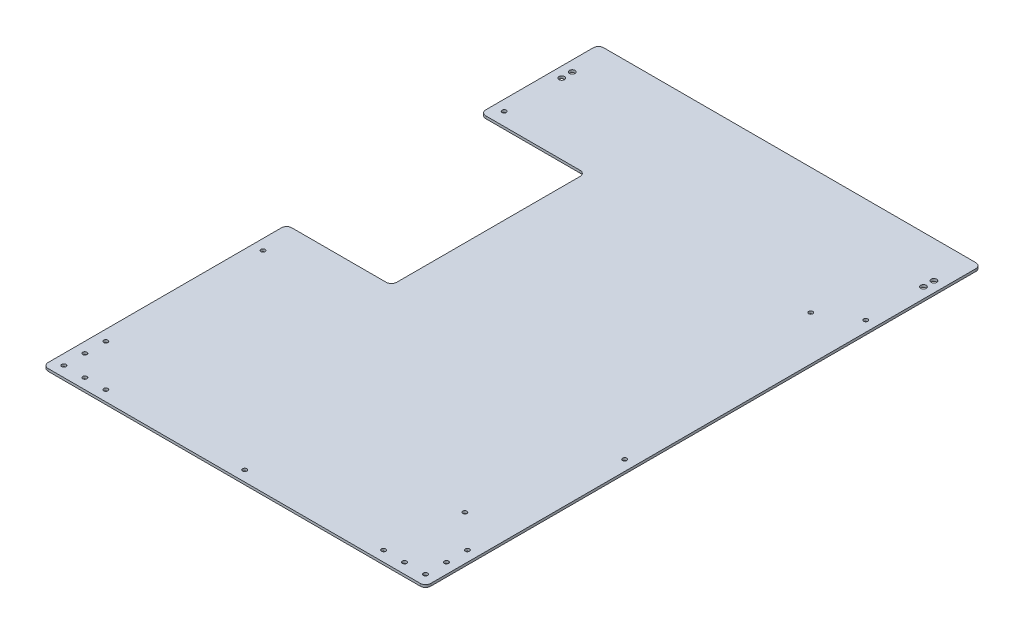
ISO-10303-21;
HEADER;
FILE_DESCRIPTION(('STEP AP214'),'2;1');
FILE_NAME('part.step','',(''),(''),'','','');
FILE_SCHEMA(('AUTOMOTIVE_DESIGN { 1 0 10303 214 1 1 1 1 }'));
ENDSEC;
DATA;
#1=APPLICATION_CONTEXT('core data for automotive mechanical design processes');
#2=APPLICATION_PROTOCOL_DEFINITION('international standard','automotive_design',2000,#1);
#3=PRODUCT_CONTEXT('',#1,'mechanical');
#4=PRODUCT('Part','Part','',(#3));
#5=PRODUCT_RELATED_PRODUCT_CATEGORY('part','',(#4));
#6=PRODUCT_DEFINITION_FORMATION('','',#4);
#7=PRODUCT_DEFINITION_CONTEXT('part definition',#1,'design');
#8=PRODUCT_DEFINITION('design','',#6,#7);
#9=PRODUCT_DEFINITION_SHAPE('','',#8);
#10=(LENGTH_UNIT() NAMED_UNIT(*) SI_UNIT(.MILLI.,.METRE.));
#11=(NAMED_UNIT(*) PLANE_ANGLE_UNIT() SI_UNIT($,.RADIAN.));
#12=(NAMED_UNIT(*) SI_UNIT($,.STERADIAN.) SOLID_ANGLE_UNIT());
#13=UNCERTAINTY_MEASURE_WITH_UNIT(LENGTH_MEASURE(1.E-05),#10,'distance_accuracy_value','');
#14=(GEOMETRIC_REPRESENTATION_CONTEXT(3) GLOBAL_UNCERTAINTY_ASSIGNED_CONTEXT((#13)) GLOBAL_UNIT_ASSIGNED_CONTEXT((#10,
#11,#12)) REPRESENTATION_CONTEXT('',''));
#15=CARTESIAN_POINT('',(0.,0.,0.));
#16=DIRECTION('',(0.,0.,1.));
#17=DIRECTION('',(1.,0.,0.));
#18=AXIS2_PLACEMENT_3D('',#15,#16,#17);
#19=CARTESIAN_POINT('',(-104.775,2.9972,0.));
#20=DIRECTION('',(1.,0.,0.));
#21=DIRECTION('',(0.,0.,-1.));
#22=AXIS2_PLACEMENT_3D('',#19,#20,#21);
#23=PLANE('',#22);
#24=DIRECTION('',(0.,0.,1.));
#25=VECTOR('',#24,1.);
#26=CARTESIAN_POINT('',(-104.775,0.,0.));
#27=LINE('',#26,#25);
#28=CARTESIAN_POINT('',(-104.775,0.,-187.325));
#29=VERTEX_POINT('',#28);
#30=CARTESIAN_POINT('',(-104.775,0.,34.925));
#31=VERTEX_POINT('',#30);
#32=EDGE_CURVE('E280',#29,#31,#27,.T.);
#33=ORIENTED_EDGE('',*,*,#32,.T.);
#34=DIRECTION('',(0.,-1.,0.));
#35=VECTOR('',#34,1.);
#36=CARTESIAN_POINT('',(-104.775,2.9972,34.925));
#37=LINE('',#36,#35);
#38=CARTESIAN_POINT('',(-104.775,2.9972,34.925));
#39=VERTEX_POINT('',#38);
#40=EDGE_CURVE('E267',#31,#39,#37,.F.);
#41=ORIENTED_EDGE('',*,*,#40,.T.);
#42=DIRECTION('',(0.,0.,1.));
#43=VECTOR('',#42,1.);
#44=CARTESIAN_POINT('',(-104.775,2.9972,0.));
#45=LINE('',#44,#43);
#46=CARTESIAN_POINT('',(-104.775,2.9972,-187.325));
#47=VERTEX_POINT('',#46);
#48=EDGE_CURVE('E286',#47,#39,#45,.T.);
#49=ORIENTED_EDGE('',*,*,#48,.F.);
#50=DIRECTION('',(0.,-1.,0.));
#51=VECTOR('',#50,1.);
#52=CARTESIAN_POINT('',(-104.775,0.,-187.325));
#53=LINE('',#52,#51);
#54=EDGE_CURVE('E263',#47,#29,#53,.T.);
#55=ORIENTED_EDGE('',*,*,#54,.T.);
#56=EDGE_LOOP('',(#33,#41,#49,#55));
#57=FACE_BOUND('',#56,.T.);
#58=ADVANCED_FACE('F39',(#57),#23,.F.);
#59=CARTESIAN_POINT('',(0.,2.9972,41.275));
#60=DIRECTION('',(0.,0.,1.));
#61=DIRECTION('',(1.,0.,0.));
#62=AXIS2_PLACEMENT_3D('',#59,#60,#61);
#63=PLANE('',#62);
#64=DIRECTION('',(-1.,0.,0.));
#65=VECTOR('',#64,1.);
#66=CARTESIAN_POINT('',(0.,0.,41.275));
#67=LINE('',#66,#65);
#68=CARTESIAN_POINT('',(-111.125,0.,41.275));
#69=VERTEX_POINT('',#68);
#70=CARTESIAN_POINT('',(-225.425,0.,41.275));
#71=VERTEX_POINT('',#70);
#72=EDGE_CURVE('E322',#69,#71,#67,.T.);
#73=ORIENTED_EDGE('',*,*,#72,.T.);
#74=DIRECTION('',(0.,-1.,0.));
#75=VECTOR('',#74,1.);
#76=CARTESIAN_POINT('',(-225.425,2.9972,41.275));
#77=LINE('',#76,#75);
#78=CARTESIAN_POINT('',(-225.425,2.9972,41.275));
#79=VERTEX_POINT('',#78);
#80=EDGE_CURVE('E248',#71,#79,#77,.F.);
#81=ORIENTED_EDGE('',*,*,#80,.T.);
#82=DIRECTION('',(-1.,0.,0.));
#83=VECTOR('',#82,1.);
#84=CARTESIAN_POINT('',(0.,2.9972,41.275));
#85=LINE('',#84,#83);
#86=CARTESIAN_POINT('',(-111.125,2.9972,41.275));
#87=VERTEX_POINT('',#86);
#88=EDGE_CURVE('E296',#87,#79,#85,.T.);
#89=ORIENTED_EDGE('',*,*,#88,.F.);
#90=DIRECTION('',(0.,-1.,0.));
#91=VECTOR('',#90,1.);
#92=CARTESIAN_POINT('',(-111.125,0.,41.275));
#93=LINE('',#92,#91);
#94=EDGE_CURVE('E244',#87,#69,#93,.T.);
#95=ORIENTED_EDGE('',*,*,#94,.T.);
#96=EDGE_LOOP('',(#73,#81,#89,#95));
#97=FACE_BOUND('',#96,.T.);
#98=ADVANCED_FACE('F370',(#97),#63,.F.);
#99=CARTESIAN_POINT('',(-231.775,2.9972,0.));
#100=DIRECTION('',(1.,0.,0.));
#101=DIRECTION('',(0.,0.,-1.));
#102=AXIS2_PLACEMENT_3D('',#99,#100,#101);
#103=PLANE('',#102);
#104=DIRECTION('',(0.,0.,1.));
#105=VECTOR('',#104,1.);
#106=CARTESIAN_POINT('',(-231.775,0.,0.));
#107=LINE('',#106,#105);
#108=CARTESIAN_POINT('',(-231.775,0.,47.625));
#109=VERTEX_POINT('',#108);
#110=CARTESIAN_POINT('',(-231.775,0.,330.2));
#111=VERTEX_POINT('',#110);
#112=EDGE_CURVE('E326',#109,#111,#107,.T.);
#113=ORIENTED_EDGE('',*,*,#112,.T.);
#114=DIRECTION('',(0.,-1.,0.));
#115=VECTOR('',#114,1.);
#116=CARTESIAN_POINT('',(-231.775,2.9972,330.2));
#117=LINE('',#116,#115);
#118=CARTESIAN_POINT('',(-231.775,2.9972,330.2));
#119=VERTEX_POINT('',#118);
#120=EDGE_CURVE('E241',#111,#119,#117,.F.);
#121=ORIENTED_EDGE('',*,*,#120,.T.);
#122=DIRECTION('',(0.,0.,1.));
#123=VECTOR('',#122,1.);
#124=CARTESIAN_POINT('',(-231.775,2.9972,0.));
#125=LINE('',#124,#123);
#126=CARTESIAN_POINT('',(-231.775,2.9972,47.625));
#127=VERTEX_POINT('',#126);
#128=EDGE_CURVE('E301',#127,#119,#125,.T.);
#129=ORIENTED_EDGE('',*,*,#128,.F.);
#130=DIRECTION('',(0.,-1.,0.));
#131=VECTOR('',#130,1.);
#132=CARTESIAN_POINT('',(-231.775,2.9972,47.625));
#133=LINE('',#132,#131);
#134=EDGE_CURVE('E237',#127,#109,#133,.T.);
#135=ORIENTED_EDGE('',*,*,#134,.T.);
#136=EDGE_LOOP('',(#113,#121,#129,#135));
#137=FACE_BOUND('',#136,.T.);
#138=ADVANCED_FACE('F362',(#137),#103,.F.);
#139=CARTESIAN_POINT('',(0.,2.9972,336.55));
#140=DIRECTION('',(0.,0.,-1.));
#141=DIRECTION('',(-1.,0.,0.));
#142=AXIS2_PLACEMENT_3D('',#139,#140,#141);
#143=PLANE('',#142);
#144=DIRECTION('',(1.,0.,0.));
#145=VECTOR('',#144,1.);
#146=CARTESIAN_POINT('',(0.,0.,336.55));
#147=LINE('',#146,#145);
#148=CARTESIAN_POINT('',(-225.425,0.,336.55));
#149=VERTEX_POINT('',#148);
#150=CARTESIAN_POINT('',(225.425,0.,336.55));
#151=VERTEX_POINT('',#150);
#152=EDGE_CURVE('E330',#149,#151,#147,.T.);
#153=ORIENTED_EDGE('',*,*,#152,.T.);
#154=DIRECTION('',(0.,-1.,0.));
#155=VECTOR('',#154,1.);
#156=CARTESIAN_POINT('',(225.425,2.9972,336.55));
#157=LINE('',#156,#155);
#158=CARTESIAN_POINT('',(225.425,2.9972,336.55));
#159=VERTEX_POINT('',#158);
#160=EDGE_CURVE('E234',#151,#159,#157,.F.);
#161=ORIENTED_EDGE('',*,*,#160,.T.);
#162=DIRECTION('',(1.,0.,0.));
#163=VECTOR('',#162,1.);
#164=CARTESIAN_POINT('',(0.,2.9972,336.55));
#165=LINE('',#164,#163);
#166=CARTESIAN_POINT('',(-225.425,2.9972,336.55));
#167=VERTEX_POINT('',#166);
#168=EDGE_CURVE('E310',#167,#159,#165,.T.);
#169=ORIENTED_EDGE('',*,*,#168,.F.);
#170=DIRECTION('',(0.,-1.,0.));
#171=VECTOR('',#170,1.);
#172=CARTESIAN_POINT('',(-225.425,2.9972,336.55));
#173=LINE('',#172,#171);
#174=EDGE_CURVE('E230',#167,#149,#173,.T.);
#175=ORIENTED_EDGE('',*,*,#174,.T.);
#176=EDGE_LOOP('',(#153,#161,#169,#175));
#177=FACE_BOUND('',#176,.T.);
#178=ADVANCED_FACE('F352',(#177),#143,.F.);
#179=CARTESIAN_POINT('',(231.775,2.9972,0.));
#180=DIRECTION('',(1.,0.,0.));
#181=DIRECTION('',(0.,0.,-1.));
#182=AXIS2_PLACEMENT_3D('',#179,#180,#181);
#183=PLANE('',#182);
#184=DIRECTION('',(0.,0.,1.));
#185=VECTOR('',#184,1.);
#186=CARTESIAN_POINT('',(231.775,0.,0.));
#187=LINE('',#186,#185);
#188=CARTESIAN_POINT('',(231.775,0.,-330.2));
#189=VERTEX_POINT('',#188);
#190=CARTESIAN_POINT('',(231.775,0.,330.2));
#191=VERTEX_POINT('',#190);
#192=EDGE_CURVE('E176',#189,#191,#187,.T.);
#193=ORIENTED_EDGE('',*,*,#192,.F.);
#194=DIRECTION('',(0.,-1.,0.));
#195=VECTOR('',#194,1.);
#196=CARTESIAN_POINT('',(231.775,2.9972,-330.2));
#197=LINE('',#196,#195);
#198=CARTESIAN_POINT('',(231.775,2.9972,-330.2));
#199=VERTEX_POINT('',#198);
#200=EDGE_CURVE('E211',#189,#199,#197,.F.);
#201=ORIENTED_EDGE('',*,*,#200,.T.);
#202=DIRECTION('',(0.,0.,1.));
#203=VECTOR('',#202,1.);
#204=CARTESIAN_POINT('',(231.775,2.9972,0.));
#205=LINE('',#204,#203);
#206=CARTESIAN_POINT('',(231.775,2.9972,330.2));
#207=VERTEX_POINT('',#206);
#208=EDGE_CURVE('E314',#199,#207,#205,.T.);
#209=ORIENTED_EDGE('',*,*,#208,.T.);
#210=DIRECTION('',(0.,-1.,0.));
#211=VECTOR('',#210,1.);
#212=CARTESIAN_POINT('',(231.775,0.,330.2));
#213=LINE('',#212,#211);
#214=EDGE_CURVE('E207',#207,#191,#213,.T.);
#215=ORIENTED_EDGE('',*,*,#214,.T.);
#216=EDGE_LOOP('',(#193,#201,#209,#215));
#217=FACE_BOUND('',#216,.T.);
#218=ADVANCED_FACE('F341',(#217),#183,.T.);
#219=CARTESIAN_POINT('',(0.,2.9972,-336.55));
#220=DIRECTION('',(0.,0.,-1.));
#221=DIRECTION('',(-1.,0.,0.));
#222=AXIS2_PLACEMENT_3D('',#219,#220,#221);
#223=PLANE('',#222);
#224=DIRECTION('',(1.,0.,0.));
#225=VECTOR('',#224,1.);
#226=CARTESIAN_POINT('',(0.,2.9972,-336.55));
#227=LINE('',#226,#225);
#228=CARTESIAN_POINT('',(-225.425,2.9972,-336.55));
#229=VERTEX_POINT('',#228);
#230=CARTESIAN_POINT('',(225.425,2.9972,-336.55));
#231=VERTEX_POINT('',#230);
#232=EDGE_CURVE('E309',#229,#231,#227,.T.);
#233=ORIENTED_EDGE('',*,*,#232,.T.);
#234=DIRECTION('',(0.,-1.,0.));
#235=VECTOR('',#234,1.);
#236=CARTESIAN_POINT('',(225.425,2.9972,-336.55));
#237=LINE('',#236,#235);
#238=CARTESIAN_POINT('',(225.425,0.,-336.55));
#239=VERTEX_POINT('',#238);
#240=EDGE_CURVE('E166',#231,#239,#237,.T.);
#241=ORIENTED_EDGE('',*,*,#240,.T.);
#242=DIRECTION('',(1.,0.,0.));
#243=VECTOR('',#242,1.);
#244=CARTESIAN_POINT('',(0.,0.,-336.55));
#245=LINE('',#244,#243);
#246=CARTESIAN_POINT('',(-225.425,0.,-336.55));
#247=VERTEX_POINT('',#246);
#248=EDGE_CURVE('E157',#247,#239,#245,.T.);
#249=ORIENTED_EDGE('',*,*,#248,.F.);
#250=DIRECTION('',(0.,-1.,0.));
#251=VECTOR('',#250,1.);
#252=CARTESIAN_POINT('',(-225.425,2.9972,-336.55));
#253=LINE('',#252,#251);
#254=EDGE_CURVE('E172',#247,#229,#253,.F.);
#255=ORIENTED_EDGE('',*,*,#254,.T.);
#256=EDGE_LOOP('',(#233,#241,#249,#255));
#257=FACE_BOUND('',#256,.T.);
#258=ADVANCED_FACE('F171',(#257),#223,.T.);
#259=CARTESIAN_POINT('',(-231.775,0.,-330.2));
#260=VERTEX_POINT('',#259);
#261=CARTESIAN_POINT('',(-231.775,0.,-200.025));
#262=VERTEX_POINT('',#261);
#263=EDGE_CURVE('E159',#260,#262,#107,.T.);
#264=ORIENTED_EDGE('',*,*,#263,.T.);
#265=DIRECTION('',(0.,-1.,0.));
#266=VECTOR('',#265,1.);
#267=CARTESIAN_POINT('',(-231.775,2.9972,-200.025));
#268=LINE('',#267,#266);
#269=CARTESIAN_POINT('',(-231.775,2.9972,-200.025));
#270=VERTEX_POINT('',#269);
#271=EDGE_CURVE('E260',#262,#270,#268,.F.);
#272=ORIENTED_EDGE('',*,*,#271,.T.);
#273=CARTESIAN_POINT('',(-231.775,2.9972,-330.2));
#274=VERTEX_POINT('',#273);
#275=EDGE_CURVE('E188',#274,#270,#125,.T.);
#276=ORIENTED_EDGE('',*,*,#275,.F.);
#277=DIRECTION('',(0.,-1.,0.));
#278=VECTOR('',#277,1.);
#279=CARTESIAN_POINT('',(-231.775,0.,-330.2));
#280=LINE('',#279,#278);
#281=EDGE_CURVE('E257',#274,#260,#280,.T.);
#282=ORIENTED_EDGE('',*,*,#281,.T.);
#283=EDGE_LOOP('',(#264,#272,#276,#282));
#284=FACE_BOUND('',#283,.T.);
#285=ADVANCED_FACE('F405',(#284),#103,.F.);
#286=CARTESIAN_POINT('',(0.,2.9972,-193.675));
#287=DIRECTION('',(0.,0.,-1.));
#288=DIRECTION('',(-1.,0.,0.));
#289=AXIS2_PLACEMENT_3D('',#286,#287,#288);
#290=PLANE('',#289);
#291=DIRECTION('',(1.,0.,0.));
#292=VECTOR('',#291,1.);
#293=CARTESIAN_POINT('',(0.,2.9972,-193.675));
#294=LINE('',#293,#292);
#295=CARTESIAN_POINT('',(-225.425,2.9972,-193.675));
#296=VERTEX_POINT('',#295);
#297=CARTESIAN_POINT('',(-111.125,2.9972,-193.675));
#298=VERTEX_POINT('',#297);
#299=EDGE_CURVE('E182',#296,#298,#294,.T.);
#300=ORIENTED_EDGE('',*,*,#299,.F.);
#301=DIRECTION('',(0.,-1.,0.));
#302=VECTOR('',#301,1.);
#303=CARTESIAN_POINT('',(-225.425,2.9972,-193.675));
#304=LINE('',#303,#302);
#305=CARTESIAN_POINT('',(-225.425,0.,-193.675));
#306=VERTEX_POINT('',#305);
#307=EDGE_CURVE('E253',#296,#306,#304,.T.);
#308=ORIENTED_EDGE('',*,*,#307,.T.);
#309=DIRECTION('',(1.,0.,0.));
#310=VECTOR('',#309,1.);
#311=CARTESIAN_POINT('',(0.,0.,-193.675));
#312=LINE('',#311,#310);
#313=CARTESIAN_POINT('',(-111.125,0.,-193.675));
#314=VERTEX_POINT('',#313);
#315=EDGE_CURVE('E191',#306,#314,#312,.T.);
#316=ORIENTED_EDGE('',*,*,#315,.T.);
#317=DIRECTION('',(0.,-1.,0.));
#318=VECTOR('',#317,1.);
#319=CARTESIAN_POINT('',(-111.125,2.9972,-193.675));
#320=LINE('',#319,#318);
#321=EDGE_CURVE('E55',#314,#298,#320,.F.);
#322=ORIENTED_EDGE('',*,*,#321,.T.);
#323=EDGE_LOOP('',(#300,#308,#316,#322));
#324=FACE_BOUND('',#323,.T.);
#325=ADVANCED_FACE('F283',(#324),#290,.F.);
#326=CARTESIAN_POINT('',(0.,2.9972,0.));
#327=DIRECTION('',(0.,1.,0.));
#328=DIRECTION('',(0.,0.,1.));
#329=AXIS2_PLACEMENT_3D('',#326,#327,#328);
#330=PLANE('',#329);
#331=CARTESIAN_POINT('',(219.075,2.9972,-279.4));
#332=DIRECTION('',(0.,1.,0.));
#333=DIRECTION('',(0.,0.,1.));
#334=AXIS2_PLACEMENT_3D('',#331,#332,#333);
#335=CIRCLE('',#334,3.373501);
#336=CARTESIAN_POINT('',(219.075,2.9972,-276.026499));
#337=VERTEX_POINT('',#336);
#338=EDGE_CURVE('E1030',#337,#337,#335,.T.);
#339=ORIENTED_EDGE('',*,*,#338,.F.);
#340=EDGE_LOOP('',(#339));
#341=FACE_BOUND('',#340,.T.);
#342=CARTESIAN_POINT('',(219.075,2.9972,-292.1));
#343=DIRECTION('',(0.,1.,0.));
#344=DIRECTION('',(0.,0.,1.));
#345=AXIS2_PLACEMENT_3D('',#342,#343,#344);
#346=CIRCLE('',#345,3.373501);
#347=CARTESIAN_POINT('',(219.075,2.9972,-288.726499));
#348=VERTEX_POINT('',#347);
#349=EDGE_CURVE('E1020',#348,#348,#346,.T.);
#350=ORIENTED_EDGE('',*,*,#349,.F.);
#351=EDGE_LOOP('',(#350));
#352=FACE_BOUND('',#351,.T.);
#353=CARTESIAN_POINT('',(-219.075,2.9972,-279.4));
#354=DIRECTION('',(0.,1.,0.));
#355=DIRECTION('',(0.,0.,1.));
#356=AXIS2_PLACEMENT_3D('',#353,#354,#355);
#357=CIRCLE('',#356,3.373501);
#358=CARTESIAN_POINT('',(-219.075,2.9972,-276.026499));
#359=VERTEX_POINT('',#358);
#360=EDGE_CURVE('E1010',#359,#359,#357,.T.);
#361=ORIENTED_EDGE('',*,*,#360,.F.);
#362=EDGE_LOOP('',(#361));
#363=FACE_BOUND('',#362,.T.);
#364=CARTESIAN_POINT('',(-219.075,2.9972,-292.1));
#365=DIRECTION('',(0.,1.,0.));
#366=DIRECTION('',(0.,0.,1.));
#367=AXIS2_PLACEMENT_3D('',#364,#365,#366);
#368=CIRCLE('',#367,3.373501);
#369=CARTESIAN_POINT('',(-219.075,2.9972,-288.726499));
#370=VERTEX_POINT('',#369);
#371=EDGE_CURVE('E1000',#370,#370,#368,.T.);
#372=ORIENTED_EDGE('',*,*,#371,.F.);
#373=EDGE_LOOP('',(#372));
#374=FACE_BOUND('',#373,.T.);
#375=CARTESIAN_POINT('',(-219.075,2.9972,323.85));
#376=DIRECTION('',(0.,1.,0.));
#377=DIRECTION('',(0.,0.,1.));
#378=AXIS2_PLACEMENT_3D('',#375,#376,#377);
#379=CIRCLE('',#378,2.55269999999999);
#380=CARTESIAN_POINT('',(-219.075,2.9972,326.4027));
#381=VERTEX_POINT('',#380);
#382=EDGE_CURVE('E990',#381,#381,#379,.T.);
#383=ORIENTED_EDGE('',*,*,#382,.F.);
#384=EDGE_LOOP('',(#383));
#385=FACE_BOUND('',#384,.T.);
#386=CARTESIAN_POINT('',(-219.075,2.9972,298.45));
#387=DIRECTION('',(0.,1.,0.));
#388=DIRECTION('',(0.,0.,1.));
#389=AXIS2_PLACEMENT_3D('',#386,#387,#388);
#390=CIRCLE('',#389,2.55269999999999);
#391=CARTESIAN_POINT('',(-219.075,2.9972,301.0027));
#392=VERTEX_POINT('',#391);
#393=EDGE_CURVE('E980',#392,#392,#390,.T.);
#394=ORIENTED_EDGE('',*,*,#393,.F.);
#395=EDGE_LOOP('',(#394));
#396=FACE_BOUND('',#395,.T.);
#397=CARTESIAN_POINT('',(-219.075,2.9972,273.05));
#398=DIRECTION('',(0.,1.,0.));
#399=DIRECTION('',(0.,0.,1.));
#400=AXIS2_PLACEMENT_3D('',#397,#398,#399);
#401=CIRCLE('',#400,2.55269999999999);
#402=CARTESIAN_POINT('',(-219.075,2.9972,275.6027));
#403=VERTEX_POINT('',#402);
#404=EDGE_CURVE('E970',#403,#403,#401,.T.);
#405=ORIENTED_EDGE('',*,*,#404,.F.);
#406=EDGE_LOOP('',(#405));
#407=FACE_BOUND('',#406,.T.);
#408=CARTESIAN_POINT('',(-193.675,2.9972,323.85));
#409=DIRECTION('',(0.,1.,0.));
#410=DIRECTION('',(0.,0.,1.));
#411=AXIS2_PLACEMENT_3D('',#408,#409,#410);
#412=CIRCLE('',#411,2.55269999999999);
#413=CARTESIAN_POINT('',(-193.675,2.9972,326.4027));
#414=VERTEX_POINT('',#413);
#415=EDGE_CURVE('E960',#414,#414,#412,.T.);
#416=ORIENTED_EDGE('',*,*,#415,.F.);
#417=EDGE_LOOP('',(#416));
#418=FACE_BOUND('',#417,.T.);
#419=CARTESIAN_POINT('',(-168.275,2.9972,323.85));
#420=DIRECTION('',(0.,1.,0.));
#421=DIRECTION('',(0.,0.,1.));
#422=AXIS2_PLACEMENT_3D('',#419,#420,#421);
#423=CIRCLE('',#422,2.55269999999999);
#424=CARTESIAN_POINT('',(-168.275,2.9972,326.4027));
#425=VERTEX_POINT('',#424);
#426=EDGE_CURVE('E950',#425,#425,#423,.T.);
#427=ORIENTED_EDGE('',*,*,#426,.F.);
#428=EDGE_LOOP('',(#427));
#429=FACE_BOUND('',#428,.T.);
#430=CARTESIAN_POINT('',(168.275,2.9972,323.85));
#431=DIRECTION('',(0.,1.,0.));
#432=DIRECTION('',(0.,0.,1.));
#433=AXIS2_PLACEMENT_3D('',#430,#431,#432);
#434=CIRCLE('',#433,2.55269999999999);
#435=CARTESIAN_POINT('',(168.275,2.9972,326.4027));
#436=VERTEX_POINT('',#435);
#437=EDGE_CURVE('E940',#436,#436,#434,.T.);
#438=ORIENTED_EDGE('',*,*,#437,.F.);
#439=EDGE_LOOP('',(#438));
#440=FACE_BOUND('',#439,.T.);
#441=CARTESIAN_POINT('',(193.675,2.9972,323.85));
#442=DIRECTION('',(0.,1.,0.));
#443=DIRECTION('',(0.,0.,1.));
#444=AXIS2_PLACEMENT_3D('',#441,#442,#443);
#445=CIRCLE('',#444,2.55269999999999);
#446=CARTESIAN_POINT('',(193.675,2.9972,326.4027));
#447=VERTEX_POINT('',#446);
#448=EDGE_CURVE('E930',#447,#447,#445,.T.);
#449=ORIENTED_EDGE('',*,*,#448,.F.);
#450=EDGE_LOOP('',(#449));
#451=FACE_BOUND('',#450,.T.);
#452=CARTESIAN_POINT('',(219.075,2.9972,323.85));
#453=DIRECTION('',(0.,1.,0.));
#454=DIRECTION('',(0.,0.,1.));
#455=AXIS2_PLACEMENT_3D('',#452,#453,#454);
#456=CIRCLE('',#455,2.55269999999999);
#457=CARTESIAN_POINT('',(219.075,2.9972,326.4027));
#458=VERTEX_POINT('',#457);
#459=EDGE_CURVE('E920',#458,#458,#456,.T.);
#460=ORIENTED_EDGE('',*,*,#459,.F.);
#461=EDGE_LOOP('',(#460));
#462=FACE_BOUND('',#461,.T.);
#463=CARTESIAN_POINT('',(219.075,2.9972,298.45));
#464=DIRECTION('',(0.,1.,0.));
#465=DIRECTION('',(0.,0.,1.));
#466=AXIS2_PLACEMENT_3D('',#463,#464,#465);
#467=CIRCLE('',#466,2.55269999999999);
#468=CARTESIAN_POINT('',(219.075,2.9972,301.0027));
#469=VERTEX_POINT('',#468);
#470=EDGE_CURVE('E910',#469,#469,#467,.T.);
#471=ORIENTED_EDGE('',*,*,#470,.F.);
#472=EDGE_LOOP('',(#471));
#473=FACE_BOUND('',#472,.T.);
#474=CARTESIAN_POINT('',(219.075,2.9972,273.05));
#475=DIRECTION('',(0.,1.,0.));
#476=DIRECTION('',(0.,0.,1.));
#477=AXIS2_PLACEMENT_3D('',#474,#475,#476);
#478=CIRCLE('',#477,2.55269999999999);
#479=CARTESIAN_POINT('',(219.075,2.9972,275.6027));
#480=VERTEX_POINT('',#479);
#481=EDGE_CURVE('E900',#480,#480,#478,.T.);
#482=ORIENTED_EDGE('',*,*,#481,.F.);
#483=EDGE_LOOP('',(#482));
#484=FACE_BOUND('',#483,.T.);
#485=CARTESIAN_POINT('',(-219.075,2.9972,82.5500000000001));
#486=DIRECTION('',(0.,1.,0.));
#487=DIRECTION('',(0.,0.,1.));
#488=AXIS2_PLACEMENT_3D('',#485,#486,#487);
#489=CIRCLE('',#488,2.55269999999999);
#490=CARTESIAN_POINT('',(-219.075,2.9972,85.1027000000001));
#491=VERTEX_POINT('',#490);
#492=EDGE_CURVE('E890',#491,#491,#489,.T.);
#493=ORIENTED_EDGE('',*,*,#492,.F.);
#494=EDGE_LOOP('',(#493));
#495=FACE_BOUND('',#494,.T.);
#496=CARTESIAN_POINT('',(-219.075,2.9972,-209.55));
#497=DIRECTION('',(0.,1.,0.));
#498=DIRECTION('',(0.,0.,1.));
#499=AXIS2_PLACEMENT_3D('',#496,#497,#498);
#500=CIRCLE('',#499,2.55269999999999);
#501=CARTESIAN_POINT('',(-219.075,2.9972,-206.9973));
#502=VERTEX_POINT('',#501);
#503=EDGE_CURVE('E880',#502,#502,#500,.T.);
#504=ORIENTED_EDGE('',*,*,#503,.F.);
#505=EDGE_LOOP('',(#504));
#506=FACE_BOUND('',#505,.T.);
#507=CARTESIAN_POINT('',(219.075,2.9972,-209.55));
#508=DIRECTION('',(0.,1.,0.));
#509=DIRECTION('',(0.,0.,1.));
#510=AXIS2_PLACEMENT_3D('',#507,#508,#509);
#511=CIRCLE('',#510,2.55269999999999);
#512=CARTESIAN_POINT('',(219.075,2.9972,-206.9973));
#513=VERTEX_POINT('',#512);
#514=EDGE_CURVE('E870',#513,#513,#511,.T.);
#515=ORIENTED_EDGE('',*,*,#514,.F.);
#516=EDGE_LOOP('',(#515));
#517=FACE_BOUND('',#516,.T.);
#518=CARTESIAN_POINT('',(219.075,2.9972,82.5500000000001));
#519=DIRECTION('',(0.,1.,0.));
#520=DIRECTION('',(0.,0.,1.));
#521=AXIS2_PLACEMENT_3D('',#518,#519,#520);
#522=CIRCLE('',#521,2.55269999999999);
#523=CARTESIAN_POINT('',(219.075,2.9972,85.1027000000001));
#524=VERTEX_POINT('',#523);
#525=EDGE_CURVE('E833',#524,#524,#522,.T.);
#526=ORIENTED_EDGE('',*,*,#525,.F.);
#527=EDGE_LOOP('',(#526));
#528=FACE_BOUND('',#527,.T.);
#529=CARTESIAN_POINT('',(0.,2.9972,323.85));
#530=DIRECTION('',(0.,1.,0.));
#531=DIRECTION('',(0.,0.,1.));
#532=AXIS2_PLACEMENT_3D('',#529,#530,#531);
#533=CIRCLE('',#532,2.55269999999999);
#534=CARTESIAN_POINT('',(0.,2.9972,326.4027));
#535=VERTEX_POINT('',#534);
#536=EDGE_CURVE('E822',#535,#535,#533,.T.);
#537=ORIENTED_EDGE('',*,*,#536,.F.);
#538=EDGE_LOOP('',(#537));
#539=FACE_BOUND('',#538,.T.);
#540=CARTESIAN_POINT('',(177.8,2.9972,-184.15));
#541=DIRECTION('',(0.,1.,0.));
#542=DIRECTION('',(0.,0.,1.));
#543=AXIS2_PLACEMENT_3D('',#540,#541,#542);
#544=CIRCLE('',#543,2.55269999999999);
#545=CARTESIAN_POINT('',(177.8,2.9972,-181.5973));
#546=VERTEX_POINT('',#545);
#547=EDGE_CURVE('E829',#546,#546,#544,.T.);
#548=ORIENTED_EDGE('',*,*,#547,.F.);
#549=EDGE_LOOP('',(#548));
#550=FACE_BOUND('',#549,.T.);
#551=CARTESIAN_POINT('',(177.8,2.9972,234.95));
#552=DIRECTION('',(0.,1.,0.));
#553=DIRECTION('',(0.,0.,1.));
#554=AXIS2_PLACEMENT_3D('',#551,#552,#553);
#555=CIRCLE('',#554,2.55269999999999);
#556=CARTESIAN_POINT('',(177.8,2.9972,237.5027));
#557=VERTEX_POINT('',#556);
#558=EDGE_CURVE('E843',#557,#557,#555,.T.);
#559=ORIENTED_EDGE('',*,*,#558,.F.);
#560=EDGE_LOOP('',(#559));
#561=FACE_BOUND('',#560,.T.);
#562=ORIENTED_EDGE('',*,*,#208,.F.);
#563=CARTESIAN_POINT('',(225.425,2.9972,-330.2));
#564=DIRECTION('',(0.,1.,0.));
#565=DIRECTION('',(0.,0.,1.));
#566=AXIS2_PLACEMENT_3D('',#563,#564,#565);
#567=CIRCLE('',#566,6.35);
#568=EDGE_CURVE('E227',#199,#231,#567,.T.);
#569=ORIENTED_EDGE('',*,*,#568,.T.);
#570=ORIENTED_EDGE('',*,*,#232,.F.);
#571=CARTESIAN_POINT('',(-225.425,2.9972,-330.2));
#572=DIRECTION('',(0.,1.,0.));
#573=DIRECTION('',(0.,0.,1.));
#574=AXIS2_PLACEMENT_3D('',#571,#572,#573);
#575=CIRCLE('',#574,6.35);
#576=EDGE_CURVE('E180',#229,#274,#575,.T.);
#577=ORIENTED_EDGE('',*,*,#576,.T.);
#578=ORIENTED_EDGE('',*,*,#275,.T.);
#579=CARTESIAN_POINT('',(-225.425,2.9972,-200.025));
#580=DIRECTION('',(0.,1.,0.));
#581=DIRECTION('',(0.,0.,1.));
#582=AXIS2_PLACEMENT_3D('',#579,#580,#581);
#583=CIRCLE('',#582,6.35);
#584=EDGE_CURVE('E62',#270,#296,#583,.T.);
#585=ORIENTED_EDGE('',*,*,#584,.T.);
#586=ORIENTED_EDGE('',*,*,#299,.T.);
#587=CARTESIAN_POINT('',(-111.125,2.9972,-187.325));
#588=DIRECTION('',(0.,1.,0.));
#589=DIRECTION('',(0.,0.,1.));
#590=AXIS2_PLACEMENT_3D('',#587,#588,#589);
#591=CIRCLE('',#590,6.35);
#592=EDGE_CURVE('E11',#298,#47,#591,.F.);
#593=ORIENTED_EDGE('',*,*,#592,.T.);
#594=ORIENTED_EDGE('',*,*,#48,.T.);
#595=CARTESIAN_POINT('',(-111.125,2.9972,34.925));
#596=DIRECTION('',(0.,1.,0.));
#597=DIRECTION('',(0.,0.,1.));
#598=AXIS2_PLACEMENT_3D('',#595,#596,#597);
#599=CIRCLE('',#598,6.35);
#600=EDGE_CURVE('E273',#39,#87,#599,.F.);
#601=ORIENTED_EDGE('',*,*,#600,.T.);
#602=ORIENTED_EDGE('',*,*,#88,.T.);
#603=CARTESIAN_POINT('',(-225.425,2.9972,47.625));
#604=DIRECTION('',(0.,1.,0.));
#605=DIRECTION('',(0.,0.,1.));
#606=AXIS2_PLACEMENT_3D('',#603,#604,#605);
#607=CIRCLE('',#606,6.35);
#608=EDGE_CURVE('E218',#79,#127,#607,.T.);
#609=ORIENTED_EDGE('',*,*,#608,.T.);
#610=ORIENTED_EDGE('',*,*,#128,.T.);
#611=CARTESIAN_POINT('',(-225.425,2.9972,330.2));
#612=DIRECTION('',(0.,1.,0.));
#613=DIRECTION('',(0.,0.,1.));
#614=AXIS2_PLACEMENT_3D('',#611,#612,#613);
#615=CIRCLE('',#614,6.35);
#616=EDGE_CURVE('E221',#119,#167,#615,.T.);
#617=ORIENTED_EDGE('',*,*,#616,.T.);
#618=ORIENTED_EDGE('',*,*,#168,.T.);
#619=CARTESIAN_POINT('',(225.425,2.9972,330.2));
#620=DIRECTION('',(0.,1.,0.));
#621=DIRECTION('',(0.,0.,1.));
#622=AXIS2_PLACEMENT_3D('',#619,#620,#621);
#623=CIRCLE('',#622,6.35);
#624=EDGE_CURVE('E224',#159,#207,#623,.T.);
#625=ORIENTED_EDGE('',*,*,#624,.T.);
#626=EDGE_LOOP('',(#562,#569,#570,#577,#578,#585,#586,#593,#594,#601,#602,#609,#610,#617,#618,#625));
#627=FACE_BOUND('',#626,.T.);
#628=ADVANCED_FACE('F291',(#341,#352,#363,#374,#385,#396,#407,#418,#429,#440,#451,#462,#473,
#484,#495,#506,#517,#528,#539,#550,#561,#627),#330,.T.);
#629=CARTESIAN_POINT('',(0.,0.,0.));
#630=DIRECTION('',(0.,1.,0.));
#631=DIRECTION('',(0.,0.,1.));
#632=AXIS2_PLACEMENT_3D('',#629,#630,#631);
#633=PLANE('',#632);
#634=CARTESIAN_POINT('',(219.075,0.,-279.4));
#635=DIRECTION('',(0.,1.,0.));
#636=DIRECTION('',(0.,0.,1.));
#637=AXIS2_PLACEMENT_3D('',#634,#635,#636);
#638=CIRCLE('',#637,3.373501);
#639=CARTESIAN_POINT('',(219.075,0.,-276.026499));
#640=VERTEX_POINT('',#639);
#641=EDGE_CURVE('E1025',#640,#640,#638,.T.);
#642=ORIENTED_EDGE('',*,*,#641,.T.);
#643=EDGE_LOOP('',(#642));
#644=FACE_BOUND('',#643,.T.);
#645=CARTESIAN_POINT('',(219.075,0.,-292.1));
#646=DIRECTION('',(0.,1.,0.));
#647=DIRECTION('',(0.,0.,1.));
#648=AXIS2_PLACEMENT_3D('',#645,#646,#647);
#649=CIRCLE('',#648,3.373501);
#650=CARTESIAN_POINT('',(219.075,0.,-288.726499));
#651=VERTEX_POINT('',#650);
#652=EDGE_CURVE('E1015',#651,#651,#649,.T.);
#653=ORIENTED_EDGE('',*,*,#652,.T.);
#654=EDGE_LOOP('',(#653));
#655=FACE_BOUND('',#654,.T.);
#656=CARTESIAN_POINT('',(-219.075,0.,-279.4));
#657=DIRECTION('',(0.,1.,0.));
#658=DIRECTION('',(0.,0.,1.));
#659=AXIS2_PLACEMENT_3D('',#656,#657,#658);
#660=CIRCLE('',#659,3.373501);
#661=CARTESIAN_POINT('',(-219.075,0.,-276.026499));
#662=VERTEX_POINT('',#661);
#663=EDGE_CURVE('E1005',#662,#662,#660,.T.);
#664=ORIENTED_EDGE('',*,*,#663,.T.);
#665=EDGE_LOOP('',(#664));
#666=FACE_BOUND('',#665,.T.);
#667=CARTESIAN_POINT('',(-219.075,0.,-292.1));
#668=DIRECTION('',(0.,1.,0.));
#669=DIRECTION('',(0.,0.,1.));
#670=AXIS2_PLACEMENT_3D('',#667,#668,#669);
#671=CIRCLE('',#670,3.373501);
#672=CARTESIAN_POINT('',(-219.075,0.,-288.726499));
#673=VERTEX_POINT('',#672);
#674=EDGE_CURVE('E995',#673,#673,#671,.T.);
#675=ORIENTED_EDGE('',*,*,#674,.T.);
#676=EDGE_LOOP('',(#675));
#677=FACE_BOUND('',#676,.T.);
#678=CARTESIAN_POINT('',(-219.075,0.,323.85));
#679=DIRECTION('',(0.,1.,0.));
#680=DIRECTION('',(0.,0.,1.));
#681=AXIS2_PLACEMENT_3D('',#678,#679,#680);
#682=CIRCLE('',#681,2.55269999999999);
#683=CARTESIAN_POINT('',(-219.075,0.,326.4027));
#684=VERTEX_POINT('',#683);
#685=EDGE_CURVE('E985',#684,#684,#682,.T.);
#686=ORIENTED_EDGE('',*,*,#685,.T.);
#687=EDGE_LOOP('',(#686));
#688=FACE_BOUND('',#687,.T.);
#689=CARTESIAN_POINT('',(-219.075,0.,298.45));
#690=DIRECTION('',(0.,1.,0.));
#691=DIRECTION('',(0.,0.,1.));
#692=AXIS2_PLACEMENT_3D('',#689,#690,#691);
#693=CIRCLE('',#692,2.55269999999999);
#694=CARTESIAN_POINT('',(-219.075,0.,301.0027));
#695=VERTEX_POINT('',#694);
#696=EDGE_CURVE('E975',#695,#695,#693,.T.);
#697=ORIENTED_EDGE('',*,*,#696,.T.);
#698=EDGE_LOOP('',(#697));
#699=FACE_BOUND('',#698,.T.);
#700=CARTESIAN_POINT('',(-219.075,0.,273.05));
#701=DIRECTION('',(0.,1.,0.));
#702=DIRECTION('',(0.,0.,1.));
#703=AXIS2_PLACEMENT_3D('',#700,#701,#702);
#704=CIRCLE('',#703,2.55269999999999);
#705=CARTESIAN_POINT('',(-219.075,0.,275.6027));
#706=VERTEX_POINT('',#705);
#707=EDGE_CURVE('E965',#706,#706,#704,.T.);
#708=ORIENTED_EDGE('',*,*,#707,.T.);
#709=EDGE_LOOP('',(#708));
#710=FACE_BOUND('',#709,.T.);
#711=CARTESIAN_POINT('',(-193.675,0.,323.85));
#712=DIRECTION('',(0.,1.,0.));
#713=DIRECTION('',(0.,0.,1.));
#714=AXIS2_PLACEMENT_3D('',#711,#712,#713);
#715=CIRCLE('',#714,2.55269999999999);
#716=CARTESIAN_POINT('',(-193.675,0.,326.4027));
#717=VERTEX_POINT('',#716);
#718=EDGE_CURVE('E955',#717,#717,#715,.T.);
#719=ORIENTED_EDGE('',*,*,#718,.T.);
#720=EDGE_LOOP('',(#719));
#721=FACE_BOUND('',#720,.T.);
#722=CARTESIAN_POINT('',(-168.275,0.,323.85));
#723=DIRECTION('',(0.,1.,0.));
#724=DIRECTION('',(0.,0.,1.));
#725=AXIS2_PLACEMENT_3D('',#722,#723,#724);
#726=CIRCLE('',#725,2.55269999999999);
#727=CARTESIAN_POINT('',(-168.275,0.,326.4027));
#728=VERTEX_POINT('',#727);
#729=EDGE_CURVE('E945',#728,#728,#726,.T.);
#730=ORIENTED_EDGE('',*,*,#729,.T.);
#731=EDGE_LOOP('',(#730));
#732=FACE_BOUND('',#731,.T.);
#733=CARTESIAN_POINT('',(168.275,0.,323.85));
#734=DIRECTION('',(0.,1.,0.));
#735=DIRECTION('',(0.,0.,1.));
#736=AXIS2_PLACEMENT_3D('',#733,#734,#735);
#737=CIRCLE('',#736,2.55269999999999);
#738=CARTESIAN_POINT('',(168.275,0.,326.4027));
#739=VERTEX_POINT('',#738);
#740=EDGE_CURVE('E935',#739,#739,#737,.T.);
#741=ORIENTED_EDGE('',*,*,#740,.T.);
#742=EDGE_LOOP('',(#741));
#743=FACE_BOUND('',#742,.T.);
#744=CARTESIAN_POINT('',(193.675,0.,323.85));
#745=DIRECTION('',(0.,1.,0.));
#746=DIRECTION('',(0.,0.,1.));
#747=AXIS2_PLACEMENT_3D('',#744,#745,#746);
#748=CIRCLE('',#747,2.55269999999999);
#749=CARTESIAN_POINT('',(193.675,0.,326.4027));
#750=VERTEX_POINT('',#749);
#751=EDGE_CURVE('E925',#750,#750,#748,.T.);
#752=ORIENTED_EDGE('',*,*,#751,.T.);
#753=EDGE_LOOP('',(#752));
#754=FACE_BOUND('',#753,.T.);
#755=CARTESIAN_POINT('',(219.075,0.,323.85));
#756=DIRECTION('',(0.,1.,0.));
#757=DIRECTION('',(0.,0.,1.));
#758=AXIS2_PLACEMENT_3D('',#755,#756,#757);
#759=CIRCLE('',#758,2.55269999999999);
#760=CARTESIAN_POINT('',(219.075,0.,326.4027));
#761=VERTEX_POINT('',#760);
#762=EDGE_CURVE('E915',#761,#761,#759,.T.);
#763=ORIENTED_EDGE('',*,*,#762,.T.);
#764=EDGE_LOOP('',(#763));
#765=FACE_BOUND('',#764,.T.);
#766=CARTESIAN_POINT('',(219.075,0.,298.45));
#767=DIRECTION('',(0.,1.,0.));
#768=DIRECTION('',(0.,0.,1.));
#769=AXIS2_PLACEMENT_3D('',#766,#767,#768);
#770=CIRCLE('',#769,2.55269999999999);
#771=CARTESIAN_POINT('',(219.075,0.,301.0027));
#772=VERTEX_POINT('',#771);
#773=EDGE_CURVE('E905',#772,#772,#770,.T.);
#774=ORIENTED_EDGE('',*,*,#773,.T.);
#775=EDGE_LOOP('',(#774));
#776=FACE_BOUND('',#775,.T.);
#777=CARTESIAN_POINT('',(219.075,0.,273.05));
#778=DIRECTION('',(0.,1.,0.));
#779=DIRECTION('',(0.,0.,1.));
#780=AXIS2_PLACEMENT_3D('',#777,#778,#779);
#781=CIRCLE('',#780,2.55269999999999);
#782=CARTESIAN_POINT('',(219.075,0.,275.6027));
#783=VERTEX_POINT('',#782);
#784=EDGE_CURVE('E895',#783,#783,#781,.T.);
#785=ORIENTED_EDGE('',*,*,#784,.T.);
#786=EDGE_LOOP('',(#785));
#787=FACE_BOUND('',#786,.T.);
#788=CARTESIAN_POINT('',(-219.075,0.,82.5500000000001));
#789=DIRECTION('',(0.,1.,0.));
#790=DIRECTION('',(0.,0.,1.));
#791=AXIS2_PLACEMENT_3D('',#788,#789,#790);
#792=CIRCLE('',#791,2.55269999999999);
#793=CARTESIAN_POINT('',(-219.075,0.,85.1027000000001));
#794=VERTEX_POINT('',#793);
#795=EDGE_CURVE('E885',#794,#794,#792,.T.);
#796=ORIENTED_EDGE('',*,*,#795,.T.);
#797=EDGE_LOOP('',(#796));
#798=FACE_BOUND('',#797,.T.);
#799=CARTESIAN_POINT('',(-219.075,0.,-209.55));
#800=DIRECTION('',(0.,1.,0.));
#801=DIRECTION('',(0.,0.,1.));
#802=AXIS2_PLACEMENT_3D('',#799,#800,#801);
#803=CIRCLE('',#802,2.55269999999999);
#804=CARTESIAN_POINT('',(-219.075,0.,-206.9973));
#805=VERTEX_POINT('',#804);
#806=EDGE_CURVE('E875',#805,#805,#803,.T.);
#807=ORIENTED_EDGE('',*,*,#806,.T.);
#808=EDGE_LOOP('',(#807));
#809=FACE_BOUND('',#808,.T.);
#810=CARTESIAN_POINT('',(219.075,0.,-209.55));
#811=DIRECTION('',(0.,1.,0.));
#812=DIRECTION('',(0.,0.,1.));
#813=AXIS2_PLACEMENT_3D('',#810,#811,#812);
#814=CIRCLE('',#813,2.55269999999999);
#815=CARTESIAN_POINT('',(219.075,0.,-206.9973));
#816=VERTEX_POINT('',#815);
#817=EDGE_CURVE('E866',#816,#816,#814,.T.);
#818=ORIENTED_EDGE('',*,*,#817,.T.);
#819=EDGE_LOOP('',(#818));
#820=FACE_BOUND('',#819,.T.);
#821=CARTESIAN_POINT('',(219.075,0.,82.5500000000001));
#822=DIRECTION('',(0.,1.,0.));
#823=DIRECTION('',(0.,0.,1.));
#824=AXIS2_PLACEMENT_3D('',#821,#822,#823);
#825=CIRCLE('',#824,2.55269999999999);
#826=CARTESIAN_POINT('',(219.075,0.,85.1027000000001));
#827=VERTEX_POINT('',#826);
#828=EDGE_CURVE('E825',#827,#827,#825,.T.);
#829=ORIENTED_EDGE('',*,*,#828,.T.);
#830=EDGE_LOOP('',(#829));
#831=FACE_BOUND('',#830,.T.);
#832=CARTESIAN_POINT('',(0.,0.,323.85));
#833=DIRECTION('',(0.,1.,0.));
#834=DIRECTION('',(0.,0.,1.));
#835=AXIS2_PLACEMENT_3D('',#832,#833,#834);
#836=CIRCLE('',#835,2.5527);
#837=CARTESIAN_POINT('',(0.,0.,326.4027));
#838=VERTEX_POINT('',#837);
#839=EDGE_CURVE('E819',#838,#838,#836,.T.);
#840=ORIENTED_EDGE('',*,*,#839,.T.);
#841=EDGE_LOOP('',(#840));
#842=FACE_BOUND('',#841,.T.);
#843=CARTESIAN_POINT('',(177.8,0.,-184.15));
#844=DIRECTION('',(0.,1.,0.));
#845=DIRECTION('',(0.,0.,1.));
#846=AXIS2_PLACEMENT_3D('',#843,#844,#845);
#847=CIRCLE('',#846,2.55269999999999);
#848=CARTESIAN_POINT('',(177.8,0.,-181.5973));
#849=VERTEX_POINT('',#848);
#850=EDGE_CURVE('E840',#849,#849,#847,.T.);
#851=ORIENTED_EDGE('',*,*,#850,.T.);
#852=EDGE_LOOP('',(#851));
#853=FACE_BOUND('',#852,.T.);
#854=CARTESIAN_POINT('',(177.8,0.,234.95));
#855=DIRECTION('',(0.,1.,0.));
#856=DIRECTION('',(0.,0.,1.));
#857=AXIS2_PLACEMENT_3D('',#854,#855,#856);
#858=CIRCLE('',#857,2.55269999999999);
#859=CARTESIAN_POINT('',(177.8,0.,237.5027));
#860=VERTEX_POINT('',#859);
#861=EDGE_CURVE('E304',#860,#860,#858,.T.);
#862=ORIENTED_EDGE('',*,*,#861,.T.);
#863=EDGE_LOOP('',(#862));
#864=FACE_BOUND('',#863,.T.);
#865=ORIENTED_EDGE('',*,*,#248,.T.);
#866=CARTESIAN_POINT('',(225.425,0.,-330.2));
#867=DIRECTION('',(0.,1.,0.));
#868=DIRECTION('',(0.,0.,1.));
#869=AXIS2_PLACEMENT_3D('',#866,#867,#868);
#870=CIRCLE('',#869,6.35);
#871=EDGE_CURVE('E204',#239,#189,#870,.F.);
#872=ORIENTED_EDGE('',*,*,#871,.T.);
#873=ORIENTED_EDGE('',*,*,#192,.T.);
#874=CARTESIAN_POINT('',(225.425,0.,330.2));
#875=DIRECTION('',(0.,1.,0.));
#876=DIRECTION('',(0.,0.,1.));
#877=AXIS2_PLACEMENT_3D('',#874,#875,#876);
#878=CIRCLE('',#877,6.35);
#879=EDGE_CURVE('E201',#191,#151,#878,.F.);
#880=ORIENTED_EDGE('',*,*,#879,.T.);
#881=ORIENTED_EDGE('',*,*,#152,.F.);
#882=CARTESIAN_POINT('',(-225.425,0.,330.2));
#883=DIRECTION('',(0.,1.,0.));
#884=DIRECTION('',(0.,0.,1.));
#885=AXIS2_PLACEMENT_3D('',#882,#883,#884);
#886=CIRCLE('',#885,6.35);
#887=EDGE_CURVE('E198',#149,#111,#886,.F.);
#888=ORIENTED_EDGE('',*,*,#887,.T.);
#889=ORIENTED_EDGE('',*,*,#112,.F.);
#890=CARTESIAN_POINT('',(-225.425,0.,47.625));
#891=DIRECTION('',(0.,1.,0.));
#892=DIRECTION('',(0.,0.,1.));
#893=AXIS2_PLACEMENT_3D('',#890,#891,#892);
#894=CIRCLE('',#893,6.35);
#895=EDGE_CURVE('E195',#109,#71,#894,.F.);
#896=ORIENTED_EDGE('',*,*,#895,.T.);
#897=ORIENTED_EDGE('',*,*,#72,.F.);
#898=CARTESIAN_POINT('',(-111.125,0.,34.925));
#899=DIRECTION('',(0.,1.,0.));
#900=DIRECTION('',(0.,0.,1.));
#901=AXIS2_PLACEMENT_3D('',#898,#899,#900);
#902=CIRCLE('',#901,6.35);
#903=EDGE_CURVE('E270',#69,#31,#902,.T.);
#904=ORIENTED_EDGE('',*,*,#903,.T.);
#905=ORIENTED_EDGE('',*,*,#32,.F.);
#906=CARTESIAN_POINT('',(-111.125,0.,-187.325));
#907=DIRECTION('',(0.,1.,0.));
#908=DIRECTION('',(0.,0.,1.));
#909=AXIS2_PLACEMENT_3D('',#906,#907,#908);
#910=CIRCLE('',#909,6.35);
#911=EDGE_CURVE('E48',#29,#314,#910,.T.);
#912=ORIENTED_EDGE('',*,*,#911,.T.);
#913=ORIENTED_EDGE('',*,*,#315,.F.);
#914=CARTESIAN_POINT('',(-225.425,0.,-200.025));
#915=DIRECTION('',(0.,1.,0.));
#916=DIRECTION('',(0.,0.,1.));
#917=AXIS2_PLACEMENT_3D('',#914,#915,#916);
#918=CIRCLE('',#917,6.35);
#919=EDGE_CURVE('E165',#306,#262,#918,.F.);
#920=ORIENTED_EDGE('',*,*,#919,.T.);
#921=ORIENTED_EDGE('',*,*,#263,.F.);
#922=CARTESIAN_POINT('',(-225.425,0.,-330.2));
#923=DIRECTION('',(0.,1.,0.));
#924=DIRECTION('',(0.,0.,1.));
#925=AXIS2_PLACEMENT_3D('',#922,#923,#924);
#926=CIRCLE('',#925,6.35);
#927=EDGE_CURVE('E154',#260,#247,#926,.F.);
#928=ORIENTED_EDGE('',*,*,#927,.T.);
#929=EDGE_LOOP('',(#865,#872,#873,#880,#881,#888,#889,#896,#897,#904,#905,#912,#913,#920,#921,#928));
#930=FACE_BOUND('',#929,.T.);
#931=ADVANCED_FACE('F156',(#644,#655,#666,#677,#688,#699,#710,#721,#732,#743,#754,#765,#776,
#787,#798,#809,#820,#831,#842,#853,#864,#930),#633,.F.);
#932=CARTESIAN_POINT('',(225.425,2.9972,-330.2));
#933=DIRECTION('',(0.,-1.,0.));
#934=DIRECTION('',(0.,0.,-1.));
#935=AXIS2_PLACEMENT_3D('',#932,#933,#934);
#936=CYLINDRICAL_SURFACE('',#935,6.35);
#937=ORIENTED_EDGE('',*,*,#568,.F.);
#938=ORIENTED_EDGE('',*,*,#200,.F.);
#939=ORIENTED_EDGE('',*,*,#871,.F.);
#940=ORIENTED_EDGE('',*,*,#240,.F.);
#941=EDGE_LOOP('',(#937,#938,#939,#940));
#942=FACE_BOUND('',#941,.T.);
#943=ADVANCED_FACE('F345',(#942),#936,.T.);
#944=CARTESIAN_POINT('',(225.425,2.9972,330.2));
#945=DIRECTION('',(0.,1.,0.));
#946=DIRECTION('',(0.,0.,1.));
#947=AXIS2_PLACEMENT_3D('',#944,#945,#946);
#948=CYLINDRICAL_SURFACE('',#947,6.35);
#949=ORIENTED_EDGE('',*,*,#624,.F.);
#950=ORIENTED_EDGE('',*,*,#160,.F.);
#951=ORIENTED_EDGE('',*,*,#879,.F.);
#952=ORIENTED_EDGE('',*,*,#214,.F.);
#953=EDGE_LOOP('',(#949,#950,#951,#952));
#954=FACE_BOUND('',#953,.T.);
#955=ADVANCED_FACE('F348',(#954),#948,.T.);
#956=CARTESIAN_POINT('',(-225.425,2.9972,330.2));
#957=DIRECTION('',(0.,-1.,0.));
#958=DIRECTION('',(0.,0.,-1.));
#959=AXIS2_PLACEMENT_3D('',#956,#957,#958);
#960=CYLINDRICAL_SURFACE('',#959,6.35);
#961=ORIENTED_EDGE('',*,*,#616,.F.);
#962=ORIENTED_EDGE('',*,*,#120,.F.);
#963=ORIENTED_EDGE('',*,*,#887,.F.);
#964=ORIENTED_EDGE('',*,*,#174,.F.);
#965=EDGE_LOOP('',(#961,#962,#963,#964));
#966=FACE_BOUND('',#965,.T.);
#967=ADVANCED_FACE('F359',(#966),#960,.T.);
#968=CARTESIAN_POINT('',(-225.425,2.9972,47.625));
#969=DIRECTION('',(0.,-1.,0.));
#970=DIRECTION('',(0.,0.,-1.));
#971=AXIS2_PLACEMENT_3D('',#968,#969,#970);
#972=CYLINDRICAL_SURFACE('',#971,6.35);
#973=ORIENTED_EDGE('',*,*,#608,.F.);
#974=ORIENTED_EDGE('',*,*,#80,.F.);
#975=ORIENTED_EDGE('',*,*,#895,.F.);
#976=ORIENTED_EDGE('',*,*,#134,.F.);
#977=EDGE_LOOP('',(#973,#974,#975,#976));
#978=FACE_BOUND('',#977,.T.);
#979=ADVANCED_FACE('F366',(#978),#972,.T.);
#980=CARTESIAN_POINT('',(-225.425,2.9972,-200.025));
#981=DIRECTION('',(0.,-1.,0.));
#982=DIRECTION('',(0.,0.,-1.));
#983=AXIS2_PLACEMENT_3D('',#980,#981,#982);
#984=CYLINDRICAL_SURFACE('',#983,6.35);
#985=ORIENTED_EDGE('',*,*,#584,.F.);
#986=ORIENTED_EDGE('',*,*,#271,.F.);
#987=ORIENTED_EDGE('',*,*,#919,.F.);
#988=ORIENTED_EDGE('',*,*,#307,.F.);
#989=EDGE_LOOP('',(#985,#986,#987,#988));
#990=FACE_BOUND('',#989,.T.);
#991=ADVANCED_FACE('F381',(#990),#984,.T.);
#992=CARTESIAN_POINT('',(-225.425,2.9972,-330.2));
#993=DIRECTION('',(0.,1.,0.));
#994=DIRECTION('',(0.,0.,1.));
#995=AXIS2_PLACEMENT_3D('',#992,#993,#994);
#996=CYLINDRICAL_SURFACE('',#995,6.35);
#997=ORIENTED_EDGE('',*,*,#576,.F.);
#998=ORIENTED_EDGE('',*,*,#254,.F.);
#999=ORIENTED_EDGE('',*,*,#927,.F.);
#1000=ORIENTED_EDGE('',*,*,#281,.F.);
#1001=EDGE_LOOP('',(#997,#998,#999,#1000));
#1002=FACE_BOUND('',#1001,.T.);
#1003=ADVANCED_FACE('F179',(#1002),#996,.T.);
#1004=CARTESIAN_POINT('',(-111.125,2.9972,34.925));
#1005=DIRECTION('',(0.,1.,0.));
#1006=DIRECTION('',(0.,0.,1.));
#1007=AXIS2_PLACEMENT_3D('',#1004,#1005,#1006);
#1008=CYLINDRICAL_SURFACE('',#1007,6.35);
#1009=ORIENTED_EDGE('',*,*,#600,.F.);
#1010=ORIENTED_EDGE('',*,*,#40,.F.);
#1011=ORIENTED_EDGE('',*,*,#903,.F.);
#1012=ORIENTED_EDGE('',*,*,#94,.F.);
#1013=EDGE_LOOP('',(#1009,#1010,#1011,#1012));
#1014=FACE_BOUND('',#1013,.T.);
#1015=ADVANCED_FACE('F374',(#1014),#1008,.F.);
#1016=CARTESIAN_POINT('',(-111.125,2.9972,-187.325));
#1017=DIRECTION('',(0.,1.,0.));
#1018=DIRECTION('',(0.,0.,1.));
#1019=AXIS2_PLACEMENT_3D('',#1016,#1017,#1018);
#1020=CYLINDRICAL_SURFACE('',#1019,6.35);
#1021=ORIENTED_EDGE('',*,*,#592,.F.);
#1022=ORIENTED_EDGE('',*,*,#321,.F.);
#1023=ORIENTED_EDGE('',*,*,#911,.F.);
#1024=ORIENTED_EDGE('',*,*,#54,.F.);
#1025=EDGE_LOOP('',(#1021,#1022,#1023,#1024));
#1026=FACE_BOUND('',#1025,.T.);
#1027=ADVANCED_FACE('F41',(#1026),#1020,.F.);
#1028=CARTESIAN_POINT('',(177.8,2.9972,234.95));
#1029=DIRECTION('',(0.,1.,0.));
#1030=DIRECTION('',(0.,0.,1.));
#1031=AXIS2_PLACEMENT_3D('',#1028,#1029,#1030);
#1032=CYLINDRICAL_SURFACE('',#1031,2.55269999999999);
#1033=ORIENTED_EDGE('',*,*,#861,.F.);
#1034=EDGE_LOOP('',(#1033));
#1035=FACE_BOUND('',#1034,.T.);
#1036=ORIENTED_EDGE('',*,*,#558,.T.);
#1037=EDGE_LOOP('',(#1036));
#1038=FACE_BOUND('',#1037,.T.);
#1039=ADVANCED_FACE('F380',(#1035,#1038),#1032,.F.);
#1040=CARTESIAN_POINT('',(177.8,2.9972,-184.15));
#1041=DIRECTION('',(0.,1.,0.));
#1042=DIRECTION('',(0.,0.,1.));
#1043=AXIS2_PLACEMENT_3D('',#1040,#1041,#1042);
#1044=CYLINDRICAL_SURFACE('',#1043,2.55269999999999);
#1045=ORIENTED_EDGE('',*,*,#850,.F.);
#1046=EDGE_LOOP('',(#1045));
#1047=FACE_BOUND('',#1046,.T.);
#1048=ORIENTED_EDGE('',*,*,#547,.T.);
#1049=EDGE_LOOP('',(#1048));
#1050=FACE_BOUND('',#1049,.T.);
#1051=ADVANCED_FACE('F513',(#1047,#1050),#1044,.F.);
#1052=CARTESIAN_POINT('',(0.,2.9972,323.85));
#1053=DIRECTION('',(0.,1.,0.));
#1054=DIRECTION('',(0.,0.,1.));
#1055=AXIS2_PLACEMENT_3D('',#1052,#1053,#1054);
#1056=CYLINDRICAL_SURFACE('',#1055,2.55269999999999);
#1057=ORIENTED_EDGE('',*,*,#839,.F.);
#1058=EDGE_LOOP('',(#1057));
#1059=FACE_BOUND('',#1058,.T.);
#1060=ORIENTED_EDGE('',*,*,#536,.T.);
#1061=EDGE_LOOP('',(#1060));
#1062=FACE_BOUND('',#1061,.T.);
#1063=ADVANCED_FACE('F523',(#1059,#1062),#1056,.F.);
#1064=CARTESIAN_POINT('',(219.075,2.9972,82.5500000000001));
#1065=DIRECTION('',(0.,1.,0.));
#1066=DIRECTION('',(0.,0.,1.));
#1067=AXIS2_PLACEMENT_3D('',#1064,#1065,#1066);
#1068=CYLINDRICAL_SURFACE('',#1067,2.55269999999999);
#1069=ORIENTED_EDGE('',*,*,#828,.F.);
#1070=EDGE_LOOP('',(#1069));
#1071=FACE_BOUND('',#1070,.T.);
#1072=ORIENTED_EDGE('',*,*,#525,.T.);
#1073=EDGE_LOOP('',(#1072));
#1074=FACE_BOUND('',#1073,.T.);
#1075=ADVANCED_FACE('F531',(#1071,#1074),#1068,.F.);
#1076=CARTESIAN_POINT('',(219.075,2.9972,-209.55));
#1077=DIRECTION('',(0.,1.,0.));
#1078=DIRECTION('',(0.,0.,1.));
#1079=AXIS2_PLACEMENT_3D('',#1076,#1077,#1078);
#1080=CYLINDRICAL_SURFACE('',#1079,2.55269999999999);
#1081=ORIENTED_EDGE('',*,*,#817,.F.);
#1082=EDGE_LOOP('',(#1081));
#1083=FACE_BOUND('',#1082,.T.);
#1084=ORIENTED_EDGE('',*,*,#514,.T.);
#1085=EDGE_LOOP('',(#1084));
#1086=FACE_BOUND('',#1085,.T.);
#1087=ADVANCED_FACE('F536',(#1083,#1086),#1080,.F.);
#1088=CARTESIAN_POINT('',(-219.075,2.9972,-209.55));
#1089=DIRECTION('',(0.,1.,0.));
#1090=DIRECTION('',(0.,0.,1.));
#1091=AXIS2_PLACEMENT_3D('',#1088,#1089,#1090);
#1092=CYLINDRICAL_SURFACE('',#1091,2.55269999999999);
#1093=ORIENTED_EDGE('',*,*,#806,.F.);
#1094=EDGE_LOOP('',(#1093));
#1095=FACE_BOUND('',#1094,.T.);
#1096=ORIENTED_EDGE('',*,*,#503,.T.);
#1097=EDGE_LOOP('',(#1096));
#1098=FACE_BOUND('',#1097,.T.);
#1099=ADVANCED_FACE('F546',(#1095,#1098),#1092,.F.);
#1100=CARTESIAN_POINT('',(-219.075,2.9972,82.5500000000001));
#1101=DIRECTION('',(0.,1.,0.));
#1102=DIRECTION('',(0.,0.,1.));
#1103=AXIS2_PLACEMENT_3D('',#1100,#1101,#1102);
#1104=CYLINDRICAL_SURFACE('',#1103,2.55269999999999);
#1105=ORIENTED_EDGE('',*,*,#795,.F.);
#1106=EDGE_LOOP('',(#1105));
#1107=FACE_BOUND('',#1106,.T.);
#1108=ORIENTED_EDGE('',*,*,#492,.T.);
#1109=EDGE_LOOP('',(#1108));
#1110=FACE_BOUND('',#1109,.T.);
#1111=ADVANCED_FACE('F556',(#1107,#1110),#1104,.F.);
#1112=CARTESIAN_POINT('',(219.075,2.9972,273.05));
#1113=DIRECTION('',(0.,1.,0.));
#1114=DIRECTION('',(0.,0.,1.));
#1115=AXIS2_PLACEMENT_3D('',#1112,#1113,#1114);
#1116=CYLINDRICAL_SURFACE('',#1115,2.55269999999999);
#1117=ORIENTED_EDGE('',*,*,#784,.F.);
#1118=EDGE_LOOP('',(#1117));
#1119=FACE_BOUND('',#1118,.T.);
#1120=ORIENTED_EDGE('',*,*,#481,.T.);
#1121=EDGE_LOOP('',(#1120));
#1122=FACE_BOUND('',#1121,.T.);
#1123=ADVANCED_FACE('F566',(#1119,#1122),#1116,.F.);
#1124=CARTESIAN_POINT('',(219.075,2.9972,298.45));
#1125=DIRECTION('',(0.,1.,0.));
#1126=DIRECTION('',(0.,0.,1.));
#1127=AXIS2_PLACEMENT_3D('',#1124,#1125,#1126);
#1128=CYLINDRICAL_SURFACE('',#1127,2.55269999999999);
#1129=ORIENTED_EDGE('',*,*,#773,.F.);
#1130=EDGE_LOOP('',(#1129));
#1131=FACE_BOUND('',#1130,.T.);
#1132=ORIENTED_EDGE('',*,*,#470,.T.);
#1133=EDGE_LOOP('',(#1132));
#1134=FACE_BOUND('',#1133,.T.);
#1135=ADVANCED_FACE('F576',(#1131,#1134),#1128,.F.);
#1136=CARTESIAN_POINT('',(219.075,2.9972,323.85));
#1137=DIRECTION('',(0.,1.,0.));
#1138=DIRECTION('',(0.,0.,1.));
#1139=AXIS2_PLACEMENT_3D('',#1136,#1137,#1138);
#1140=CYLINDRICAL_SURFACE('',#1139,2.55269999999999);
#1141=ORIENTED_EDGE('',*,*,#762,.F.);
#1142=EDGE_LOOP('',(#1141));
#1143=FACE_BOUND('',#1142,.T.);
#1144=ORIENTED_EDGE('',*,*,#459,.T.);
#1145=EDGE_LOOP('',(#1144));
#1146=FACE_BOUND('',#1145,.T.);
#1147=ADVANCED_FACE('F586',(#1143,#1146),#1140,.F.);
#1148=CARTESIAN_POINT('',(193.675,2.9972,323.85));
#1149=DIRECTION('',(0.,1.,0.));
#1150=DIRECTION('',(0.,0.,1.));
#1151=AXIS2_PLACEMENT_3D('',#1148,#1149,#1150);
#1152=CYLINDRICAL_SURFACE('',#1151,2.55269999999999);
#1153=ORIENTED_EDGE('',*,*,#751,.F.);
#1154=EDGE_LOOP('',(#1153));
#1155=FACE_BOUND('',#1154,.T.);
#1156=ORIENTED_EDGE('',*,*,#448,.T.);
#1157=EDGE_LOOP('',(#1156));
#1158=FACE_BOUND('',#1157,.T.);
#1159=ADVANCED_FACE('F596',(#1155,#1158),#1152,.F.);
#1160=CARTESIAN_POINT('',(168.275,2.9972,323.85));
#1161=DIRECTION('',(0.,1.,0.));
#1162=DIRECTION('',(0.,0.,1.));
#1163=AXIS2_PLACEMENT_3D('',#1160,#1161,#1162);
#1164=CYLINDRICAL_SURFACE('',#1163,2.55269999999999);
#1165=ORIENTED_EDGE('',*,*,#740,.F.);
#1166=EDGE_LOOP('',(#1165));
#1167=FACE_BOUND('',#1166,.T.);
#1168=ORIENTED_EDGE('',*,*,#437,.T.);
#1169=EDGE_LOOP('',(#1168));
#1170=FACE_BOUND('',#1169,.T.);
#1171=ADVANCED_FACE('F606',(#1167,#1170),#1164,.F.);
#1172=CARTESIAN_POINT('',(-168.275,2.9972,323.85));
#1173=DIRECTION('',(0.,1.,0.));
#1174=DIRECTION('',(0.,0.,1.));
#1175=AXIS2_PLACEMENT_3D('',#1172,#1173,#1174);
#1176=CYLINDRICAL_SURFACE('',#1175,2.55269999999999);
#1177=ORIENTED_EDGE('',*,*,#729,.F.);
#1178=EDGE_LOOP('',(#1177));
#1179=FACE_BOUND('',#1178,.T.);
#1180=ORIENTED_EDGE('',*,*,#426,.T.);
#1181=EDGE_LOOP('',(#1180));
#1182=FACE_BOUND('',#1181,.T.);
#1183=ADVANCED_FACE('F616',(#1179,#1182),#1176,.F.);
#1184=CARTESIAN_POINT('',(-193.675,2.9972,323.85));
#1185=DIRECTION('',(0.,1.,0.));
#1186=DIRECTION('',(0.,0.,1.));
#1187=AXIS2_PLACEMENT_3D('',#1184,#1185,#1186);
#1188=CYLINDRICAL_SURFACE('',#1187,2.55269999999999);
#1189=ORIENTED_EDGE('',*,*,#718,.F.);
#1190=EDGE_LOOP('',(#1189));
#1191=FACE_BOUND('',#1190,.T.);
#1192=ORIENTED_EDGE('',*,*,#415,.T.);
#1193=EDGE_LOOP('',(#1192));
#1194=FACE_BOUND('',#1193,.T.);
#1195=ADVANCED_FACE('F626',(#1191,#1194),#1188,.F.);
#1196=CARTESIAN_POINT('',(-219.075,2.9972,273.05));
#1197=DIRECTION('',(0.,1.,0.));
#1198=DIRECTION('',(0.,0.,1.));
#1199=AXIS2_PLACEMENT_3D('',#1196,#1197,#1198);
#1200=CYLINDRICAL_SURFACE('',#1199,2.55269999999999);
#1201=ORIENTED_EDGE('',*,*,#707,.F.);
#1202=EDGE_LOOP('',(#1201));
#1203=FACE_BOUND('',#1202,.T.);
#1204=ORIENTED_EDGE('',*,*,#404,.T.);
#1205=EDGE_LOOP('',(#1204));
#1206=FACE_BOUND('',#1205,.T.);
#1207=ADVANCED_FACE('F636',(#1203,#1206),#1200,.F.);
#1208=CARTESIAN_POINT('',(-219.075,2.9972,298.45));
#1209=DIRECTION('',(0.,1.,0.));
#1210=DIRECTION('',(0.,0.,1.));
#1211=AXIS2_PLACEMENT_3D('',#1208,#1209,#1210);
#1212=CYLINDRICAL_SURFACE('',#1211,2.55269999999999);
#1213=ORIENTED_EDGE('',*,*,#696,.F.);
#1214=EDGE_LOOP('',(#1213));
#1215=FACE_BOUND('',#1214,.T.);
#1216=ORIENTED_EDGE('',*,*,#393,.T.);
#1217=EDGE_LOOP('',(#1216));
#1218=FACE_BOUND('',#1217,.T.);
#1219=ADVANCED_FACE('F646',(#1215,#1218),#1212,.F.);
#1220=CARTESIAN_POINT('',(-219.075,2.9972,323.85));
#1221=DIRECTION('',(0.,1.,0.));
#1222=DIRECTION('',(0.,0.,1.));
#1223=AXIS2_PLACEMENT_3D('',#1220,#1221,#1222);
#1224=CYLINDRICAL_SURFACE('',#1223,2.55269999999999);
#1225=ORIENTED_EDGE('',*,*,#685,.F.);
#1226=EDGE_LOOP('',(#1225));
#1227=FACE_BOUND('',#1226,.T.);
#1228=ORIENTED_EDGE('',*,*,#382,.T.);
#1229=EDGE_LOOP('',(#1228));
#1230=FACE_BOUND('',#1229,.T.);
#1231=ADVANCED_FACE('F656',(#1227,#1230),#1224,.F.);
#1232=CARTESIAN_POINT('',(-219.075,2.9972,-292.1));
#1233=DIRECTION('',(0.,1.,0.));
#1234=DIRECTION('',(0.,0.,1.));
#1235=AXIS2_PLACEMENT_3D('',#1232,#1233,#1234);
#1236=CYLINDRICAL_SURFACE('',#1235,3.373501);
#1237=ORIENTED_EDGE('',*,*,#674,.F.);
#1238=EDGE_LOOP('',(#1237));
#1239=FACE_BOUND('',#1238,.T.);
#1240=ORIENTED_EDGE('',*,*,#371,.T.);
#1241=EDGE_LOOP('',(#1240));
#1242=FACE_BOUND('',#1241,.T.);
#1243=ADVANCED_FACE('F665',(#1239,#1242),#1236,.F.);
#1244=CARTESIAN_POINT('',(-219.075,2.9972,-279.4));
#1245=DIRECTION('',(0.,1.,0.));
#1246=DIRECTION('',(0.,0.,1.));
#1247=AXIS2_PLACEMENT_3D('',#1244,#1245,#1246);
#1248=CYLINDRICAL_SURFACE('',#1247,3.373501);
#1249=ORIENTED_EDGE('',*,*,#663,.F.);
#1250=EDGE_LOOP('',(#1249));
#1251=FACE_BOUND('',#1250,.T.);
#1252=ORIENTED_EDGE('',*,*,#360,.T.);
#1253=EDGE_LOOP('',(#1252));
#1254=FACE_BOUND('',#1253,.T.);
#1255=ADVANCED_FACE('F674',(#1251,#1254),#1248,.F.);
#1256=CARTESIAN_POINT('',(219.075,2.9972,-292.1));
#1257=DIRECTION('',(0.,1.,0.));
#1258=DIRECTION('',(0.,0.,1.));
#1259=AXIS2_PLACEMENT_3D('',#1256,#1257,#1258);
#1260=CYLINDRICAL_SURFACE('',#1259,3.373501);
#1261=ORIENTED_EDGE('',*,*,#652,.F.);
#1262=EDGE_LOOP('',(#1261));
#1263=FACE_BOUND('',#1262,.T.);
#1264=ORIENTED_EDGE('',*,*,#349,.T.);
#1265=EDGE_LOOP('',(#1264));
#1266=FACE_BOUND('',#1265,.T.);
#1267=ADVANCED_FACE('F684',(#1263,#1266),#1260,.F.);
#1268=CARTESIAN_POINT('',(219.075,2.9972,-279.4));
#1269=DIRECTION('',(0.,1.,0.));
#1270=DIRECTION('',(0.,0.,1.));
#1271=AXIS2_PLACEMENT_3D('',#1268,#1269,#1270);
#1272=CYLINDRICAL_SURFACE('',#1271,3.373501);
#1273=ORIENTED_EDGE('',*,*,#641,.F.);
#1274=EDGE_LOOP('',(#1273));
#1275=FACE_BOUND('',#1274,.T.);
#1276=ORIENTED_EDGE('',*,*,#338,.T.);
#1277=EDGE_LOOP('',(#1276));
#1278=FACE_BOUND('',#1277,.T.);
#1279=ADVANCED_FACE('F694',(#1275,#1278),#1272,.F.);
#1280=CLOSED_SHELL('',(#58,#98,#138,#178,#218,#258,#285,#325,#628,#931,#943,#955,#967,#979,#991,
#1003,#1015,#1027,#1039,#1051,#1063,#1075,#1087,#1099,#1111,#1123,#1135,#1147,#1159,#1171,#1183,
#1195,#1207,#1219,#1231,#1243,#1255,#1267,#1279));
#1281=MANIFOLD_SOLID_BREP('B2',#1280);
#1282=ADVANCED_BREP_SHAPE_REPRESENTATION('',(#18,#1281),#14);
#1283=SHAPE_DEFINITION_REPRESENTATION(#9,#1282);
ENDSEC;
END-ISO-10303-21;
